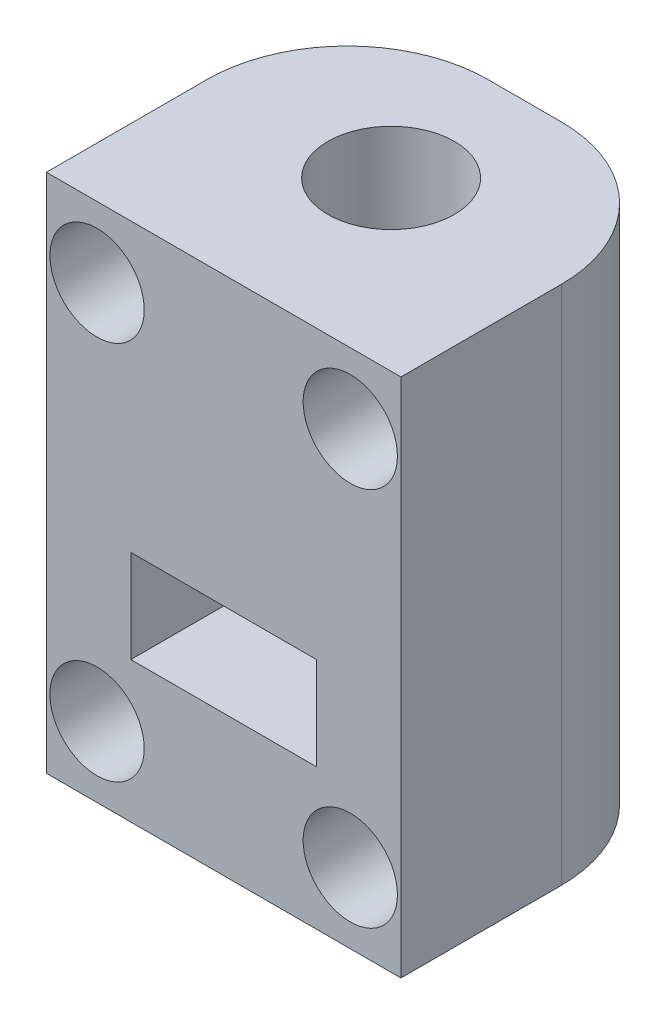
from build123d import *

# Parameters (mm, degrees)
ESQUISSE1_W             = 25.2
ESQUISSE1_H             = 37
BOSS_EXTRU_1_DEPTH      = 21.4
ENL_V_START             = -10
ESQUISSE2_R             = 4.5
ENL_V_MAT_EXTRU_1_DEPTH = 18
ENL_V_MAT_EXTRU_3_DEPTH = 6.6
ESQUISSE6_R             = 4.5
ENL_V_MAT_EXTRU_4_DEPTH = 50.61854492
CONG_1_R                = 10
ESQUISSE5_R             = 3.35
ENL_V_MAT_EXTRU_5_DEPTH = 10


with BuildPart() as part:
    # Esquisse1 → Boss.-Extru.1 (new body)
    with BuildSketch(Plane.XY):
        with Locations((12.6, 18.5)):
            Rectangle(ESQUISSE1_W, ESQUISSE1_H)
    extrude(amount=BOSS_EXTRU_1_DEPTH)

    # Esquisse2 → Enl_v. mat.-Extru.1 (cut)
    with BuildSketch(Plane(origin=(0, 0, 0), x_dir=(-1, 0, 0), z_dir=(0, -1, 0)).offset(ENL_V_START)):
        with Locations(Location((-12.6, -9.5, 0), (0, 0, 90))):
            Circle(ESQUISSE2_R)
    extrude(amount=-ENL_V_MAT_EXTRU_1_DEPTH, mode=Mode.SUBTRACT)

    # Esquisse4 → Enl_v. mat.-Extru.3 (cut)
    with BuildSketch(Plane.XZ.offset(ENL_V_START)):
        Polygon((6, 13.310511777), (6, 23.218119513), (19.2, 23.218119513), (19.2, 13.310511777), (19.2, 5.689488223), (12.6, 1.878976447), (6, 5.689488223), align=None)
    extrude(amount=-ENL_V_MAT_EXTRU_3_DEPTH, mode=Mode.SUBTRACT)

    # Esquisse6 → Enl_v. mat.-Extru.4 (cut, through all)
    with BuildSketch(Plane(origin=(0, 0, 0), x_dir=(-1, 0, 0), z_dir=(0, -1, 0))):
        with Locations(Location((-12.6, -9.5, 0), (0, 0, 90))):
            Circle(ESQUISSE6_R)
    extrude(amount=-ENL_V_MAT_EXTRU_4_DEPTH, mode=Mode.SUBTRACT)

    # Cong_1
    cong_1_edges = [part.edges().sort_by_distance(p)[0] for p in [
        (25.2, 18.5, 0),
        (0, 18.5, 0),
    ]]
    fillet(cong_1_edges, radius=CONG_1_R)

    # Esquisse5 → Enl_v. mat.-Extru.5 (cut)
    with BuildSketch(Plane.XY.offset(21.4)):
        with Locations((3.6, 32)):
            Circle(ESQUISSE5_R)
        with Locations((21.6, 32)):
            Circle(ESQUISSE5_R)
        with Locations((3.6, 5)):
            Circle(ESQUISSE5_R)
        with Locations((21.6, 5)):
            Circle(ESQUISSE5_R)
    extrude(amount=-ENL_V_MAT_EXTRU_5_DEPTH, mode=Mode.SUBTRACT)


solid = part.part
